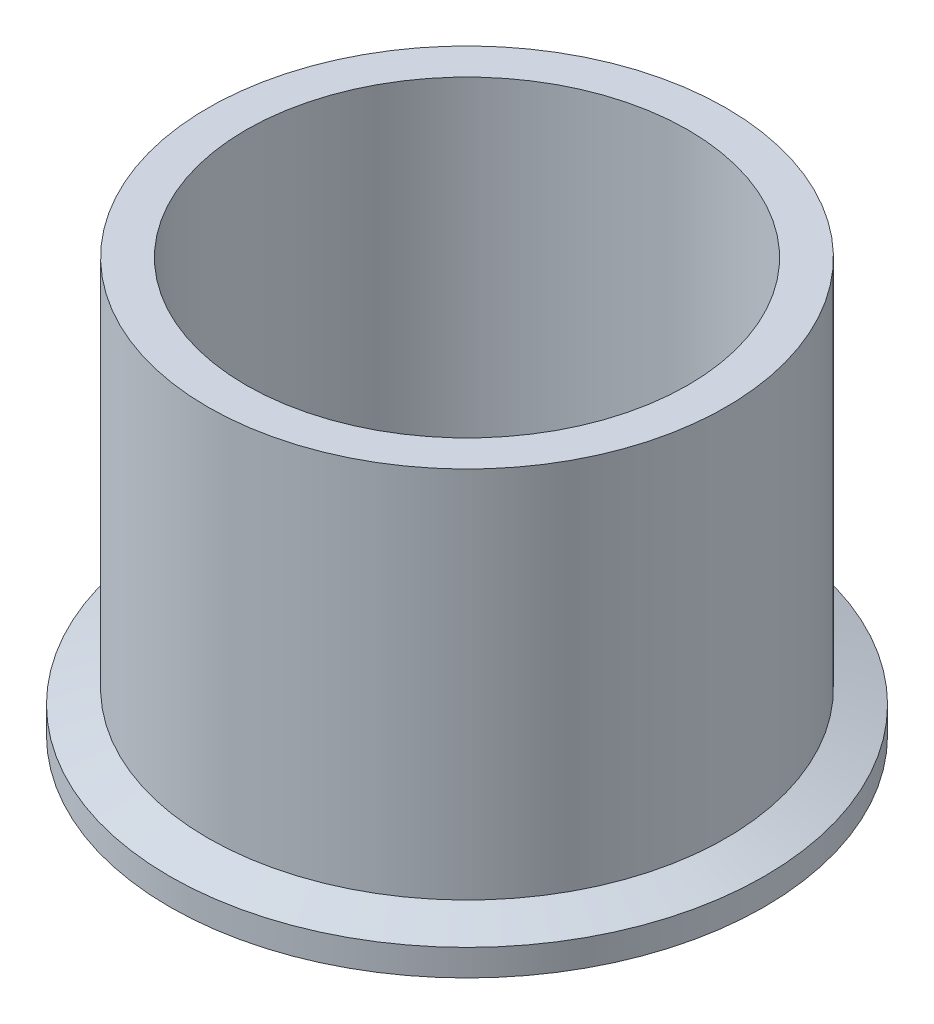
ISO-10303-21;
HEADER;
FILE_DESCRIPTION(('STEP AP214'),'2;1');
FILE_NAME('part.step','',(''),(''),'','','');
FILE_SCHEMA(('AUTOMOTIVE_DESIGN { 1 0 10303 214 1 1 1 1 }'));
ENDSEC;
DATA;
#1=APPLICATION_CONTEXT('core data for automotive mechanical design processes');
#2=APPLICATION_PROTOCOL_DEFINITION('international standard','automotive_design',2000,#1);
#3=PRODUCT_CONTEXT('',#1,'mechanical');
#4=PRODUCT('Part','Part','',(#3));
#5=PRODUCT_RELATED_PRODUCT_CATEGORY('part','',(#4));
#6=PRODUCT_DEFINITION_FORMATION('','',#4);
#7=PRODUCT_DEFINITION_CONTEXT('part definition',#1,'design');
#8=PRODUCT_DEFINITION('design','',#6,#7);
#9=PRODUCT_DEFINITION_SHAPE('','',#8);
#10=(LENGTH_UNIT() NAMED_UNIT(*) SI_UNIT(.MILLI.,.METRE.));
#11=(NAMED_UNIT(*) PLANE_ANGLE_UNIT() SI_UNIT($,.RADIAN.));
#12=(NAMED_UNIT(*) SI_UNIT($,.STERADIAN.) SOLID_ANGLE_UNIT());
#13=UNCERTAINTY_MEASURE_WITH_UNIT(LENGTH_MEASURE(1.E-05),#10,'distance_accuracy_value','');
#14=(GEOMETRIC_REPRESENTATION_CONTEXT(3) GLOBAL_UNCERTAINTY_ASSIGNED_CONTEXT((#13)) GLOBAL_UNIT_ASSIGNED_CONTEXT((#10,
#11,#12)) REPRESENTATION_CONTEXT('',''));
#15=CARTESIAN_POINT('',(0.,0.,0.));
#16=DIRECTION('',(0.,0.,1.));
#17=DIRECTION('',(1.,0.,0.));
#18=AXIS2_PLACEMENT_3D('',#15,#16,#17);
#19=CARTESIAN_POINT('',(0.,0.,0.));
#20=DIRECTION('',(0.,1.,0.));
#21=DIRECTION('',(0.,0.,1.));
#22=AXIS2_PLACEMENT_3D('',#19,#20,#21);
#23=PLANE('',#22);
#24=CARTESIAN_POINT('',(0.,0.,0.));
#25=DIRECTION('',(0.,-1.,0.));
#26=DIRECTION('',(0.,0.,-1.));
#27=AXIS2_PLACEMENT_3D('',#24,#25,#26);
#28=CIRCLE('',#27,29.9742414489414);
#29=CARTESIAN_POINT('',(0.,0.,-29.9742414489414));
#30=VERTEX_POINT('',#29);
#31=EDGE_CURVE('E10',#30,#30,#28,.T.);
#32=ORIENTED_EDGE('',*,*,#31,.F.);
#33=EDGE_LOOP('',(#32));
#34=FACE_BOUND('',#33,.T.);
#35=CARTESIAN_POINT('',(0.,0.,0.));
#36=DIRECTION('',(0.,-1.,0.));
#37=DIRECTION('',(0.,0.,-1.));
#38=AXIS2_PLACEMENT_3D('',#35,#36,#37);
#39=CIRCLE('',#38,31.9532);
#40=CARTESIAN_POINT('',(0.,0.,-31.9532));
#41=VERTEX_POINT('',#40);
#42=EDGE_CURVE('E73',#41,#41,#39,.T.);
#43=ORIENTED_EDGE('',*,*,#42,.T.);
#44=EDGE_LOOP('',(#43));
#45=FACE_BOUND('',#44,.T.);
#46=ADVANCED_FACE('F33',(#34,#45),#23,.F.);
#47=CARTESIAN_POINT('',(0.,0.508,0.));
#48=DIRECTION('',(0.,-1.,0.));
#49=DIRECTION('',(0.,0.,-1.));
#50=AXIS2_PLACEMENT_3D('',#47,#48,#49);
#51=TOROIDAL_SURFACE('',#50,29.9742414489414,0.507999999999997);
#52=CARTESIAN_POINT('',(0.,0.309508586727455,0.));
#53=DIRECTION('',(0.,-1.,0.));
#54=DIRECTION('',(0.,0.,-1.));
#55=AXIS2_PLACEMENT_3D('',#52,#53,#54);
#56=CIRCLE('',#55,29.5066249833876);
#57=CARTESIAN_POINT('',(0.,0.309508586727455,-29.5066249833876));
#58=VERTEX_POINT('',#57);
#59=EDGE_CURVE('E39',#58,#58,#56,.T.);
#60=ORIENTED_EDGE('',*,*,#59,.F.);
#61=EDGE_LOOP('',(#60));
#62=FACE_BOUND('',#61,.T.);
#63=ORIENTED_EDGE('',*,*,#31,.T.);
#64=EDGE_LOOP('',(#63));
#65=FACE_BOUND('',#64,.T.);
#66=ADVANCED_FACE('F114',(#62,#65),#51,.T.);
#67=CARTESIAN_POINT('',(0.,0.872854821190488,0.));
#68=DIRECTION('',(0.,-1.,0.));
#69=DIRECTION('',(0.,0.,-1.));
#70=AXIS2_PLACEMENT_3D('',#67,#68,#69);
#71=CONICAL_SURFACE('',#70,29.2674986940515,0.4014257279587);
#72=ORIENTED_EDGE('',*,*,#59,.T.);
#73=EDGE_LOOP('',(#72));
#74=FACE_BOUND('',#73,.T.);
#75=CARTESIAN_POINT('',(0.,0.872854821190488,0.));
#76=DIRECTION('',(0.,-1.,0.));
#77=DIRECTION('',(0.,0.,-1.));
#78=AXIS2_PLACEMENT_3D('',#75,#76,#77);
#79=CIRCLE('',#78,29.2674986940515);
#80=CARTESIAN_POINT('',(0.,0.872854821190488,-29.2674986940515));
#81=VERTEX_POINT('',#80);
#82=EDGE_CURVE('E43',#81,#81,#79,.T.);
#83=ORIENTED_EDGE('',*,*,#82,.F.);
#84=EDGE_LOOP('',(#83));
#85=FACE_BOUND('',#84,.T.);
#86=ADVANCED_FACE('F119',(#74,#85),#71,.F.);
#87=CARTESIAN_POINT('',(0.,0.4064,0.));
#88=DIRECTION('',(0.,-1.,0.));
#89=DIRECTION('',(0.,0.,-1.));
#90=AXIS2_PLACEMENT_3D('',#87,#88,#89);
#91=TOROIDAL_SURFACE('',#90,28.1686,1.1938);
#92=CARTESIAN_POINT('',(0.,0.872854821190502,0.));
#93=DIRECTION('',(0.,-1.,0.));
#94=DIRECTION('',(0.,0.,-1.));
#95=AXIS2_PLACEMENT_3D('',#92,#93,#94);
#96=CIRCLE('',#95,27.0697013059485);
#97=CARTESIAN_POINT('',(0.,0.872854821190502,-27.0697013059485));
#98=VERTEX_POINT('',#97);
#99=EDGE_CURVE('E47',#98,#98,#96,.T.);
#100=ORIENTED_EDGE('',*,*,#99,.F.);
#101=EDGE_LOOP('',(#100));
#102=FACE_BOUND('',#101,.T.);
#103=ORIENTED_EDGE('',*,*,#82,.T.);
#104=EDGE_LOOP('',(#103));
#105=FACE_BOUND('',#104,.T.);
#106=ADVANCED_FACE('F124',(#102,#105),#91,.F.);
#107=CARTESIAN_POINT('',(0.,0.872854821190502,0.));
#108=DIRECTION('',(0.,1.,0.));
#109=DIRECTION('',(0.,0.,1.));
#110=AXIS2_PLACEMENT_3D('',#107,#108,#109);
#111=CONICAL_SURFACE('',#110,27.0697013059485,0.401425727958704);
#112=CARTESIAN_POINT('',(0.,0.309508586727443,0.));
#113=DIRECTION('',(0.,-1.,0.));
#114=DIRECTION('',(0.,0.,-1.));
#115=AXIS2_PLACEMENT_3D('',#112,#113,#114);
#116=CIRCLE('',#115,26.8305750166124);
#117=CARTESIAN_POINT('',(0.,0.309508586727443,-26.8305750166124));
#118=VERTEX_POINT('',#117);
#119=EDGE_CURVE('E52',#118,#118,#116,.T.);
#120=ORIENTED_EDGE('',*,*,#119,.F.);
#121=EDGE_LOOP('',(#120));
#122=FACE_BOUND('',#121,.T.);
#123=ORIENTED_EDGE('',*,*,#99,.T.);
#124=EDGE_LOOP('',(#123));
#125=FACE_BOUND('',#124,.T.);
#126=ADVANCED_FACE('F129',(#122,#125),#111,.T.);
#127=CARTESIAN_POINT('',(0.,0.508,0.));
#128=DIRECTION('',(0.,-1.,0.));
#129=DIRECTION('',(0.,0.,-1.));
#130=AXIS2_PLACEMENT_3D('',#127,#128,#129);
#131=TOROIDAL_SURFACE('',#130,26.3629585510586,0.508000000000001);
#132=ORIENTED_EDGE('',*,*,#119,.T.);
#133=EDGE_LOOP('',(#132));
#134=FACE_BOUND('',#133,.T.);
#135=CARTESIAN_POINT('',(0.,0.,0.));
#136=DIRECTION('',(0.,-1.,0.));
#137=DIRECTION('',(0.,0.,-1.));
#138=AXIS2_PLACEMENT_3D('',#135,#136,#137);
#139=CIRCLE('',#138,26.3629585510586);
#140=CARTESIAN_POINT('',(0.,0.,-26.3629585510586));
#141=VERTEX_POINT('',#140);
#142=EDGE_CURVE('E55',#141,#141,#139,.T.);
#143=ORIENTED_EDGE('',*,*,#142,.F.);
#144=EDGE_LOOP('',(#143));
#145=FACE_BOUND('',#144,.T.);
#146=ADVANCED_FACE('F110',(#134,#145),#131,.T.);
#147=CARTESIAN_POINT('',(0.,0.,0.));
#148=DIRECTION('',(0.,1.,0.));
#149=DIRECTION('',(0.,0.,1.));
#150=AXIS2_PLACEMENT_3D('',#147,#148,#149);
#151=PLANE('',#150);
#152=CARTESIAN_POINT('',(0.,0.,0.));
#153=DIRECTION('',(0.,-1.,0.));
#154=DIRECTION('',(0.,0.,-1.));
#155=AXIS2_PLACEMENT_3D('',#152,#153,#154);
#156=CIRCLE('',#155,23.749);
#157=CARTESIAN_POINT('',(0.,0.,-23.749));
#158=VERTEX_POINT('',#157);
#159=EDGE_CURVE('E58',#158,#158,#156,.T.);
#160=ORIENTED_EDGE('',*,*,#159,.F.);
#161=EDGE_LOOP('',(#160));
#162=FACE_BOUND('',#161,.T.);
#163=ORIENTED_EDGE('',*,*,#142,.T.);
#164=EDGE_LOOP('',(#163));
#165=FACE_BOUND('',#164,.T.);
#166=ADVANCED_FACE('F104',(#162,#165),#151,.F.);
#167=CARTESIAN_POINT('',(0.,0.,0.));
#168=DIRECTION('',(0.,-1.,0.));
#169=DIRECTION('',(0.,0.,-1.));
#170=AXIS2_PLACEMENT_3D('',#167,#168,#169);
#171=CYLINDRICAL_SURFACE('',#170,23.749);
#172=ORIENTED_EDGE('',*,*,#159,.T.);
#173=EDGE_LOOP('',(#172));
#174=FACE_BOUND('',#173,.T.);
#175=CARTESIAN_POINT('',(0.,44.45,0.));
#176=DIRECTION('',(0.,-1.,0.));
#177=DIRECTION('',(0.,0.,-1.));
#178=AXIS2_PLACEMENT_3D('',#175,#176,#177);
#179=CIRCLE('',#178,23.749);
#180=CARTESIAN_POINT('',(0.,44.45,-23.749));
#181=VERTEX_POINT('',#180);
#182=EDGE_CURVE('E61',#181,#181,#179,.T.);
#183=ORIENTED_EDGE('',*,*,#182,.F.);
#184=EDGE_LOOP('',(#183));
#185=FACE_BOUND('',#184,.T.);
#186=ADVANCED_FACE('F99',(#174,#185),#171,.F.);
#187=CARTESIAN_POINT('',(0.,44.45,0.));
#188=DIRECTION('',(0.,-1.,0.));
#189=DIRECTION('',(0.,0.,-1.));
#190=AXIS2_PLACEMENT_3D('',#187,#188,#189);
#191=PLANE('',#190);
#192=CARTESIAN_POINT('',(0.,44.45,0.));
#193=DIRECTION('',(0.,-1.,0.));
#194=DIRECTION('',(0.,0.,-1.));
#195=AXIS2_PLACEMENT_3D('',#192,#193,#194);
#196=CIRCLE('',#195,27.8384);
#197=CARTESIAN_POINT('',(0.,44.45,-27.8384));
#198=VERTEX_POINT('',#197);
#199=EDGE_CURVE('E64',#198,#198,#196,.T.);
#200=ORIENTED_EDGE('',*,*,#199,.F.);
#201=EDGE_LOOP('',(#200));
#202=FACE_BOUND('',#201,.T.);
#203=ORIENTED_EDGE('',*,*,#182,.T.);
#204=EDGE_LOOP('',(#203));
#205=FACE_BOUND('',#204,.T.);
#206=ADVANCED_FACE('F93',(#202,#205),#191,.F.);
#207=CARTESIAN_POINT('',(0.,0.,0.));
#208=DIRECTION('',(0.,-1.,0.));
#209=DIRECTION('',(0.,0.,-1.));
#210=AXIS2_PLACEMENT_3D('',#207,#208,#209);
#211=CYLINDRICAL_SURFACE('',#210,27.8384);
#212=CARTESIAN_POINT('',(0.,4.34246471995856,0.));
#213=DIRECTION('',(0.,-1.,0.));
#214=DIRECTION('',(0.,0.,-1.));
#215=AXIS2_PLACEMENT_3D('',#212,#213,#214);
#216=CIRCLE('',#215,27.8384);
#217=CARTESIAN_POINT('',(0.,4.34246471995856,-27.8384));
#218=VERTEX_POINT('',#217);
#219=EDGE_CURVE('E67',#218,#218,#216,.T.);
#220=ORIENTED_EDGE('',*,*,#219,.F.);
#221=EDGE_LOOP('',(#220));
#222=FACE_BOUND('',#221,.T.);
#223=ORIENTED_EDGE('',*,*,#199,.T.);
#224=EDGE_LOOP('',(#223));
#225=FACE_BOUND('',#224,.T.);
#226=ADVANCED_FACE('F87',(#222,#225),#211,.T.);
#227=CARTESIAN_POINT('',(0.,4.34246471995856,0.));
#228=DIRECTION('',(0.,-1.,0.));
#229=DIRECTION('',(0.,0.,-1.));
#230=AXIS2_PLACEMENT_3D('',#227,#228,#229);
#231=CONICAL_SURFACE('',#230,27.8384,1.22173047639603);
#232=CARTESIAN_POINT('',(0.,2.8448,0.));
#233=DIRECTION('',(0.,-1.,0.));
#234=DIRECTION('',(0.,0.,-1.));
#235=AXIS2_PLACEMENT_3D('',#232,#233,#234);
#236=CIRCLE('',#235,31.9532);
#237=CARTESIAN_POINT('',(0.,2.8448,-31.9532));
#238=VERTEX_POINT('',#237);
#239=EDGE_CURVE('E70',#238,#238,#236,.T.);
#240=ORIENTED_EDGE('',*,*,#239,.F.);
#241=EDGE_LOOP('',(#240));
#242=FACE_BOUND('',#241,.T.);
#243=ORIENTED_EDGE('',*,*,#219,.T.);
#244=EDGE_LOOP('',(#243));
#245=FACE_BOUND('',#244,.T.);
#246=ADVANCED_FACE('F81',(#242,#245),#231,.T.);
#247=CARTESIAN_POINT('',(0.,0.,0.));
#248=DIRECTION('',(0.,-1.,0.));
#249=DIRECTION('',(0.,0.,-1.));
#250=AXIS2_PLACEMENT_3D('',#247,#248,#249);
#251=CYLINDRICAL_SURFACE('',#250,31.9532);
#252=ORIENTED_EDGE('',*,*,#42,.F.);
#253=EDGE_LOOP('',(#252));
#254=FACE_BOUND('',#253,.T.);
#255=ORIENTED_EDGE('',*,*,#239,.T.);
#256=EDGE_LOOP('',(#255));
#257=FACE_BOUND('',#256,.T.);
#258=ADVANCED_FACE('F78',(#254,#257),#251,.T.);
#259=CLOSED_SHELL('',(#46,#66,#86,#106,#126,#146,#166,#186,#206,#226,#246,#258));
#260=MANIFOLD_SOLID_BREP('B2',#259);
#261=ADVANCED_BREP_SHAPE_REPRESENTATION('',(#18,#260),#14);
#262=SHAPE_DEFINITION_REPRESENTATION(#9,#261);
ENDSEC;
END-ISO-10303-21;
